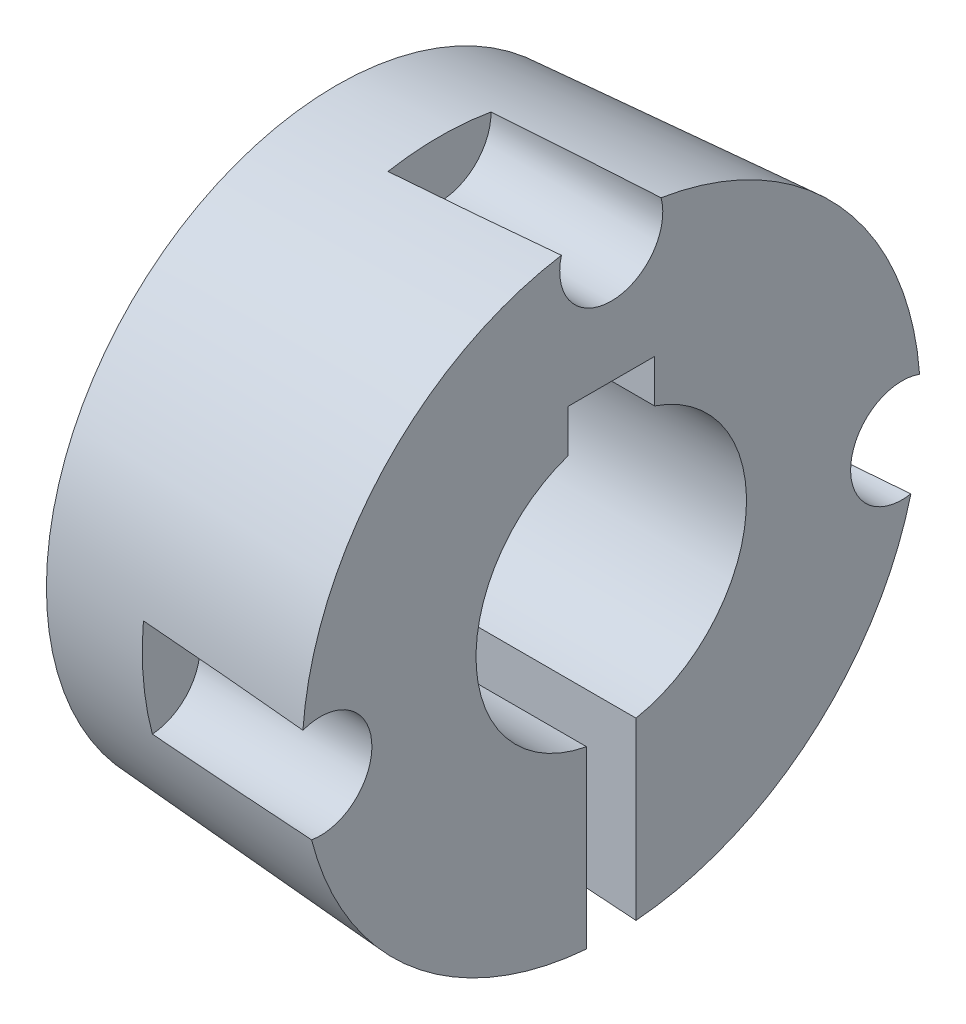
ISO-10303-21;
HEADER;
FILE_DESCRIPTION(('STEP AP214'),'2;1');
FILE_NAME('part.step','',(''),(''),'','','');
FILE_SCHEMA(('AUTOMOTIVE_DESIGN { 1 0 10303 214 1 1 1 1 }'));
ENDSEC;
DATA;
#1=APPLICATION_CONTEXT('core data for automotive mechanical design processes');
#2=APPLICATION_PROTOCOL_DEFINITION('international standard','automotive_design',2000,#1);
#3=PRODUCT_CONTEXT('',#1,'mechanical');
#4=PRODUCT('Part','Part','',(#3));
#5=PRODUCT_RELATED_PRODUCT_CATEGORY('part','',(#4));
#6=PRODUCT_DEFINITION_FORMATION('','',#4);
#7=PRODUCT_DEFINITION_CONTEXT('part definition',#1,'design');
#8=PRODUCT_DEFINITION('design','',#6,#7);
#9=PRODUCT_DEFINITION_SHAPE('','',#8);
#10=(LENGTH_UNIT() NAMED_UNIT(*) SI_UNIT(.MILLI.,.METRE.));
#11=(NAMED_UNIT(*) PLANE_ANGLE_UNIT() SI_UNIT($,.RADIAN.));
#12=(NAMED_UNIT(*) SI_UNIT($,.STERADIAN.) SOLID_ANGLE_UNIT());
#13=UNCERTAINTY_MEASURE_WITH_UNIT(LENGTH_MEASURE(1.E-05),#10,'distance_accuracy_value','');
#14=(GEOMETRIC_REPRESENTATION_CONTEXT(3) GLOBAL_UNCERTAINTY_ASSIGNED_CONTEXT((#13)) GLOBAL_UNIT_ASSIGNED_CONTEXT((#10,
#11,#12)) REPRESENTATION_CONTEXT('',''));
#15=CARTESIAN_POINT('',(0.,0.,0.));
#16=DIRECTION('',(0.,0.,1.));
#17=DIRECTION('',(1.,0.,0.));
#18=AXIS2_PLACEMENT_3D('',#15,#16,#17);
#19=CARTESIAN_POINT('',(25.4,14.2875,0.));
#20=DIRECTION('',(1.,0.,0.));
#21=DIRECTION('',(0.,-1.,0.));
#22=AXIS2_PLACEMENT_3D('',#19,#20,#21);
#23=PLANE('',#22);
#24=DIRECTION('',(0.,1.,0.));
#25=VECTOR('',#24,1.);
#26=CARTESIAN_POINT('',(25.4,-1.42875,2.286));
#27=LINE('',#26,#25);
#28=CARTESIAN_POINT('',(25.4,-28.4834132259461,2.286));
#29=VERTEX_POINT('',#28);
#30=CARTESIAN_POINT('',(25.4,-12.2891905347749,2.286));
#31=VERTEX_POINT('',#30);
#32=EDGE_CURVE('E264',#29,#31,#27,.T.);
#33=ORIENTED_EDGE('',*,*,#32,.T.);
#34=CARTESIAN_POINT('',(25.4,0.,0.));
#35=DIRECTION('',(-1.,0.,0.));
#36=DIRECTION('',(0.,0.,-1.));
#37=AXIS2_PLACEMENT_3D('',#34,#35,#36);
#38=CIRCLE('',#37,12.5);
#39=CARTESIAN_POINT('',(25.4,11.842719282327,4.));
#40=VERTEX_POINT('',#39);
#41=EDGE_CURVE('E129',#31,#40,#38,.T.);
#42=ORIENTED_EDGE('',*,*,#41,.T.);
#43=DIRECTION('',(0.,1.,0.));
#44=VECTOR('',#43,1.);
#45=CARTESIAN_POINT('',(25.4,11.09375,4.));
#46=LINE('',#45,#44);
#47=CARTESIAN_POINT('',(25.4,15.8,4.));
#48=VERTEX_POINT('',#47);
#49=EDGE_CURVE('E407',#40,#48,#46,.T.);
#50=ORIENTED_EDGE('',*,*,#49,.T.);
#51=DIRECTION('',(0.,0.,-1.));
#52=VECTOR('',#51,1.);
#53=CARTESIAN_POINT('',(25.4,15.8,0.));
#54=LINE('',#53,#52);
#55=CARTESIAN_POINT('',(25.4,15.8,-4.));
#56=VERTEX_POINT('',#55);
#57=EDGE_CURVE('E9',#48,#56,#54,.T.);
#58=ORIENTED_EDGE('',*,*,#57,.T.);
#59=DIRECTION('',(0.,-1.,0.));
#60=VECTOR('',#59,1.);
#61=CARTESIAN_POINT('',(25.4,11.09375,-4.));
#62=LINE('',#61,#60);
#63=CARTESIAN_POINT('',(25.4,11.842719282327,-4.));
#64=VERTEX_POINT('',#63);
#65=EDGE_CURVE('E307',#56,#64,#62,.T.);
#66=ORIENTED_EDGE('',*,*,#65,.T.);
#67=CARTESIAN_POINT('',(25.4,0.,0.));
#68=DIRECTION('',(-1.,0.,0.));
#69=DIRECTION('',(0.,0.,-1.));
#70=AXIS2_PLACEMENT_3D('',#67,#68,#69);
#71=CIRCLE('',#70,12.5);
#72=CARTESIAN_POINT('',(25.4,-12.2891905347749,-2.286));
#73=VERTEX_POINT('',#72);
#74=EDGE_CURVE('E394',#64,#73,#71,.T.);
#75=ORIENTED_EDGE('',*,*,#74,.T.);
#76=DIRECTION('',(0.,-1.,0.));
#77=VECTOR('',#76,1.);
#78=CARTESIAN_POINT('',(25.4,-1.42875,-2.286));
#79=LINE('',#78,#77);
#80=CARTESIAN_POINT('',(25.4,-28.4834132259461,-2.286));
#81=VERTEX_POINT('',#80);
#82=EDGE_CURVE('E274',#73,#81,#79,.T.);
#83=ORIENTED_EDGE('',*,*,#82,.T.);
#84=CARTESIAN_POINT('',(25.4,0.,0.));
#85=DIRECTION('',(-1.,0.,0.));
#86=DIRECTION('',(0.,1.,0.));
#87=AXIS2_PLACEMENT_3D('',#84,#85,#86);
#88=CIRCLE('',#87,28.575);
#89=CARTESIAN_POINT('',(25.4,-7.04557588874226,-27.6927876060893));
#90=VERTEX_POINT('',#89);
#91=EDGE_CURVE('E231',#90,#81,#88,.T.);
#92=ORIENTED_EDGE('',*,*,#91,.F.);
#93=CARTESIAN_POINT('',(25.4,-2.35211560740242,-26.884804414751));
#94=DIRECTION('',(-1.,0.,0.));
#95=DIRECTION('',(0.,-0.996194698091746,0.0871557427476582));
#96=AXIS2_PLACEMENT_3D('',#93,#94,#95);
#97=CIRCLE('',#96,4.7625);
#98=CARTESIAN_POINT('',(25.4,2.1297356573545,-28.4955233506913));
#99=VERTEX_POINT('',#98);
#100=EDGE_CURVE('E115',#90,#99,#97,.T.);
#101=ORIENTED_EDGE('',*,*,#100,.T.);
#102=CARTESIAN_POINT('',(25.4,0.,0.));
#103=DIRECTION('',(-1.,0.,0.));
#104=DIRECTION('',(0.,1.,0.));
#105=AXIS2_PLACEMENT_3D('',#102,#103,#104);
#106=CIRCLE('',#105,28.575);
#107=CARTESIAN_POINT('',(25.4,28.2014705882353,-4.60517987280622));
#108=VERTEX_POINT('',#107);
#109=EDGE_CURVE('E101',#108,#99,#106,.T.);
#110=ORIENTED_EDGE('',*,*,#109,.F.);
#111=CARTESIAN_POINT('',(25.4,26.9875,0.));
#112=DIRECTION('',(-1.,0.,0.));
#113=DIRECTION('',(0.,0.,-1.));
#114=AXIS2_PLACEMENT_3D('',#111,#112,#113);
#115=CIRCLE('',#114,4.7625);
#116=CARTESIAN_POINT('',(25.4,28.2014705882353,4.60517987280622));
#117=VERTEX_POINT('',#116);
#118=EDGE_CURVE('E312',#108,#117,#115,.T.);
#119=ORIENTED_EDGE('',*,*,#118,.T.);
#120=CARTESIAN_POINT('',(25.4,0.,0.));
#121=DIRECTION('',(-1.,0.,0.));
#122=DIRECTION('',(0.,1.,0.));
#123=AXIS2_PLACEMENT_3D('',#120,#121,#122);
#124=CIRCLE('',#123,28.575);
#125=CARTESIAN_POINT('',(25.4,2.1297356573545,28.4955233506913));
#126=VERTEX_POINT('',#125);
#127=EDGE_CURVE('E221',#126,#117,#124,.T.);
#128=ORIENTED_EDGE('',*,*,#127,.F.);
#129=CARTESIAN_POINT('',(25.4,-2.35211560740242,26.884804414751));
#130=DIRECTION('',(-1.,0.,0.));
#131=DIRECTION('',(0.,0.996194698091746,0.0871557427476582));
#132=AXIS2_PLACEMENT_3D('',#129,#130,#131);
#133=CIRCLE('',#132,4.7625);
#134=CARTESIAN_POINT('',(25.4,-7.04557588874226,27.6927876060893));
#135=VERTEX_POINT('',#134);
#136=EDGE_CURVE('E218',#126,#135,#133,.T.);
#137=ORIENTED_EDGE('',*,*,#136,.T.);
#138=CARTESIAN_POINT('',(25.4,0.,0.));
#139=DIRECTION('',(-1.,0.,0.));
#140=DIRECTION('',(0.,1.,0.));
#141=AXIS2_PLACEMENT_3D('',#138,#139,#140);
#142=CIRCLE('',#141,28.575);
#143=EDGE_CURVE('E118',#29,#135,#142,.T.);
#144=ORIENTED_EDGE('',*,*,#143,.F.);
#145=EDGE_LOOP('',(#33,#42,#50,#58,#66,#75,#83,#92,#101,#110,#119,#128,#137,#144));
#146=FACE_BOUND('',#145,.T.);
#147=ADVANCED_FACE('F15',(#146),#23,.T.);
#148=CARTESIAN_POINT('',(12.7,15.8,0.));
#149=DIRECTION('',(0.,-1.,0.));
#150=DIRECTION('',(0.,0.,-1.));
#151=AXIS2_PLACEMENT_3D('',#148,#149,#150);
#152=PLANE('',#151);
#153=DIRECTION('',(0.,0.,1.));
#154=VECTOR('',#153,1.);
#155=CARTESIAN_POINT('',(0.,15.8,0.));
#156=LINE('',#155,#154);
#157=CARTESIAN_POINT('',(0.,15.8,-4.));
#158=VERTEX_POINT('',#157);
#159=CARTESIAN_POINT('',(0.,15.8,4.));
#160=VERTEX_POINT('',#159);
#161=EDGE_CURVE('E286',#158,#160,#156,.T.);
#162=ORIENTED_EDGE('',*,*,#161,.F.);
#163=DIRECTION('',(1.,0.,0.));
#164=VECTOR('',#163,1.);
#165=CARTESIAN_POINT('',(12.7,15.8,-4.));
#166=LINE('',#165,#164);
#167=EDGE_CURVE('E27',#158,#56,#166,.T.);
#168=ORIENTED_EDGE('',*,*,#167,.T.);
#169=ORIENTED_EDGE('',*,*,#57,.F.);
#170=DIRECTION('',(-1.,0.,0.));
#171=VECTOR('',#170,1.);
#172=CARTESIAN_POINT('',(12.7,15.8,4.));
#173=LINE('',#172,#171);
#174=EDGE_CURVE('E315',#48,#160,#173,.T.);
#175=ORIENTED_EDGE('',*,*,#174,.T.);
#176=EDGE_LOOP('',(#162,#168,#169,#175));
#177=FACE_BOUND('',#176,.T.);
#178=ADVANCED_FACE('F366',(#177),#152,.T.);
#179=CARTESIAN_POINT('',(12.7,7.9,-4.));
#180=DIRECTION('',(0.,0.,1.));
#181=DIRECTION('',(1.,0.,0.));
#182=AXIS2_PLACEMENT_3D('',#179,#180,#181);
#183=PLANE('',#182);
#184=DIRECTION('',(0.,1.,0.));
#185=VECTOR('',#184,1.);
#186=CARTESIAN_POINT('',(0.,10.6504363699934,-4.));
#187=LINE('',#186,#185);
#188=CARTESIAN_POINT('',(0.,11.842719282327,-4.));
#189=VERTEX_POINT('',#188);
#190=EDGE_CURVE('E290',#189,#158,#187,.T.);
#191=ORIENTED_EDGE('',*,*,#190,.F.);
#192=DIRECTION('',(-1.,0.,0.));
#193=VECTOR('',#192,1.);
#194=CARTESIAN_POINT('',(12.7,11.842719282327,-4.));
#195=LINE('',#194,#193);
#196=EDGE_CURVE('E302',#64,#189,#195,.T.);
#197=ORIENTED_EDGE('',*,*,#196,.F.);
#198=ORIENTED_EDGE('',*,*,#65,.F.);
#199=ORIENTED_EDGE('',*,*,#167,.F.);
#200=EDGE_LOOP('',(#191,#197,#198,#199));
#201=FACE_BOUND('',#200,.T.);
#202=ADVANCED_FACE('F358',(#201),#183,.T.);
#203=CARTESIAN_POINT('',(12.7,7.9,4.));
#204=DIRECTION('',(0.,0.,1.));
#205=DIRECTION('',(1.,0.,0.));
#206=AXIS2_PLACEMENT_3D('',#203,#204,#205);
#207=PLANE('',#206);
#208=DIRECTION('',(0.,-1.,0.));
#209=VECTOR('',#208,1.);
#210=CARTESIAN_POINT('',(0.,10.6504363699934,4.));
#211=LINE('',#210,#209);
#212=CARTESIAN_POINT('',(0.,11.842719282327,4.));
#213=VERTEX_POINT('',#212);
#214=EDGE_CURVE('E289',#160,#213,#211,.T.);
#215=ORIENTED_EDGE('',*,*,#214,.F.);
#216=ORIENTED_EDGE('',*,*,#174,.F.);
#217=ORIENTED_EDGE('',*,*,#49,.F.);
#218=DIRECTION('',(1.,0.,0.));
#219=VECTOR('',#218,1.);
#220=CARTESIAN_POINT('',(12.7,11.842719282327,4.));
#221=LINE('',#220,#219);
#222=EDGE_CURVE('E132',#213,#40,#221,.T.);
#223=ORIENTED_EDGE('',*,*,#222,.F.);
#224=EDGE_LOOP('',(#215,#216,#217,#223));
#225=FACE_BOUND('',#224,.T.);
#226=ADVANCED_FACE('F355',(#225),#207,.F.);
#227=CARTESIAN_POINT('',(17.9625,26.9875,0.));
#228=DIRECTION('',(-1.,0.,0.));
#229=DIRECTION('',(0.,0.,-1.));
#230=AXIS2_PLACEMENT_3D('',#227,#228,#229);
#231=CYLINDRICAL_SURFACE('',#230,4.7625);
#232=CARTESIAN_POINT('',(25.3999989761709,28.201475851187,4.60514719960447));
#233=CARTESIAN_POINT('',(24.7489113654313,28.1533533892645,4.61779770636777));
#234=CARTESIAN_POINT('',(24.0977998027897,28.1053413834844,4.62963009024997));
#235=CARTESIAN_POINT('',(22.7926204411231,28.009326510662,4.65174823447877));
#236=CARTESIAN_POINT('',(22.138552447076,27.9613246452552,4.66202683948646));
#237=CARTESIAN_POINT('',(20.8274602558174,27.8653353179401,4.68105689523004));
#238=CARTESIAN_POINT('',(20.1704358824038,27.8173488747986,4.68980133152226));
#239=CARTESIAN_POINT('',(18.8534308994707,27.7213946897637,4.70578237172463));
#240=CARTESIAN_POINT('',(18.193450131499,27.6734279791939,4.71301210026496));
#241=CARTESIAN_POINT('',(16.8705323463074,27.5775168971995,4.72598319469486));
#242=CARTESIAN_POINT('',(16.2075951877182,27.5295735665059,4.73171782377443));
#243=CARTESIAN_POINT('',(14.8787646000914,27.433712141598,4.74171823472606));
#244=CARTESIAN_POINT('',(14.2128710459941,27.3857950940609,4.74597741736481));
#245=CARTESIAN_POINT('',(12.8781276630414,27.2899884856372,4.75304659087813));
#246=CARTESIAN_POINT('',(12.2092777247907,27.2420999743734,4.75585011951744));
#247=CARTESIAN_POINT('',(10.86862151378,27.1463518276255,4.76002748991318));
#248=CARTESIAN_POINT('',(10.1968151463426,27.0984932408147,4.76139500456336));
#249=CARTESIAN_POINT('',(9.52499968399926,27.0507541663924,4.7620564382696));
#250=B_SPLINE_CURVE_WITH_KNOTS('',3,(#232,#233,#234,#235,#236,#237,#238,#239,#240,#241,#242,
#243,#244,#245,#246,#247,#248,#249),.UNSPECIFIED.,.F.,.F.,(4,2,2,2,2,2,2,2,4),(0.,
1.95895770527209,3.9266784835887,5.90317393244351,7.88845525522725,9.88253326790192,
11.8854184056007,13.8971207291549,15.9176499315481),.UNSPECIFIED.);
#251=CARTESIAN_POINT('',(9.525,27.0507500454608,4.76207997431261));
#252=VERTEX_POINT('',#251);
#253=EDGE_CURVE('E245',#117,#252,#250,.T.);
#254=ORIENTED_EDGE('',*,*,#253,.F.);
#255=ORIENTED_EDGE('',*,*,#118,.F.);
#256=CARTESIAN_POINT('',(9.52499968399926,27.0507541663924,-4.76205643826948));
#257=CARTESIAN_POINT('',(10.1968151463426,27.0984932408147,-4.76139500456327));
#258=CARTESIAN_POINT('',(10.86862151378,27.1463518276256,-4.7600274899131));
#259=CARTESIAN_POINT('',(12.2092777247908,27.2420999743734,-4.75585011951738));
#260=CARTESIAN_POINT('',(12.8781276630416,27.2899884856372,-4.75304659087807));
#261=CARTESIAN_POINT('',(14.2128710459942,27.3857950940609,-4.74597741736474));
#262=CARTESIAN_POINT('',(14.8787646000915,27.433712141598,-4.74171823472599));
#263=CARTESIAN_POINT('',(16.2075951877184,27.5295735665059,-4.73171782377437));
#264=CARTESIAN_POINT('',(16.8705323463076,27.5775168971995,-4.72598319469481));
#265=CARTESIAN_POINT('',(18.1934501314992,27.6734279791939,-4.71301210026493));
#266=CARTESIAN_POINT('',(18.8534308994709,27.7213946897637,-4.70578237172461));
#267=CARTESIAN_POINT('',(20.1704358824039,27.8173488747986,-4.68980133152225));
#268=CARTESIAN_POINT('',(20.8274602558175,27.8653353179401,-4.68105689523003));
#269=CARTESIAN_POINT('',(22.1385524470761,27.9613246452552,-4.66202683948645));
#270=CARTESIAN_POINT('',(22.7926204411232,28.009326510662,-4.65174823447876));
#271=CARTESIAN_POINT('',(24.0977998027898,28.1053413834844,-4.62963009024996));
#272=CARTESIAN_POINT('',(24.7489113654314,28.1533533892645,-4.61779770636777));
#273=CARTESIAN_POINT('',(25.3999989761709,28.201475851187,-4.60514719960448));
#274=B_SPLINE_CURVE_WITH_KNOTS('',3,(#256,#257,#258,#259,#260,#261,#262,#263,#264,#265,#266,
#267,#268,#269,#270,#271,#272,#273),.UNSPECIFIED.,.F.,.F.,(4,2,2,2,2,2,2,2,4),(0.,
2.02052920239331,4.03223152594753,6.03511666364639,8.02919467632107,10.0144759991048,
11.9909714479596,13.9586922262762,15.9176499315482),.UNSPECIFIED.);
#275=CARTESIAN_POINT('',(9.525,27.0507500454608,-4.76207997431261));
#276=VERTEX_POINT('',#275);
#277=EDGE_CURVE('E239',#276,#108,#274,.T.);
#278=ORIENTED_EDGE('',*,*,#277,.F.);
#279=CARTESIAN_POINT('',(9.525,26.9875,0.));
#280=DIRECTION('',(-1.,0.,0.));
#281=DIRECTION('',(0.,0.,-1.));
#282=AXIS2_PLACEMENT_3D('',#279,#280,#281);
#283=CIRCLE('',#282,4.7625);
#284=EDGE_CURVE('E254',#276,#252,#283,.T.);
#285=ORIENTED_EDGE('',*,*,#284,.T.);
#286=EDGE_LOOP('',(#254,#255,#278,#285));
#287=FACE_BOUND('',#286,.T.);
#288=ADVANCED_FACE('F151',(#287),#231,.F.);
#289=CARTESIAN_POINT('',(9.525,26.9875,0.));
#290=DIRECTION('',(-1.,0.,0.));
#291=DIRECTION('',(0.,0.,1.));
#292=AXIS2_PLACEMENT_3D('',#289,#290,#291);
#293=PLANE('',#292);
#294=CARTESIAN_POINT('',(9.525,0.,0.));
#295=DIRECTION('',(-1.,0.,0.));
#296=DIRECTION('',(0.,1.,0.));
#297=AXIS2_PLACEMENT_3D('',#294,#295,#296);
#298=CIRCLE('',#297,27.4667159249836);
#299=EDGE_CURVE('E242',#252,#276,#298,.T.);
#300=ORIENTED_EDGE('',*,*,#299,.F.);
#301=ORIENTED_EDGE('',*,*,#284,.F.);
#302=EDGE_LOOP('',(#300,#301));
#303=FACE_BOUND('',#302,.T.);
#304=ADVANCED_FACE('F202',(#303),#293,.F.);
#305=CARTESIAN_POINT('',(17.9625,-2.35211560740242,26.884804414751));
#306=DIRECTION('',(-1.,0.,0.));
#307=DIRECTION('',(0.,0.996194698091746,0.0871557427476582));
#308=AXIS2_PLACEMENT_3D('',#305,#306,#307);
#309=CYLINDRICAL_SURFACE('',#308,4.7625);
#310=CARTESIAN_POINT('',(25.3999989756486,-7.04554378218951,27.6927957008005));
#311=CARTESIAN_POINT('',(24.7489109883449,-7.05395200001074,27.6437537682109));
#312=CARTESIAN_POINT('',(24.0977990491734,-7.06155483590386,27.5948931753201));
#313=CARTESIAN_POINT('',(22.7926190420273,-7.07522056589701,27.49731589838));
#314=CARTESIAN_POINT('',(22.1385507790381,-7.08127641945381,27.4486008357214));
#315=CARTESIAN_POINT('',(20.8274581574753,-7.09186803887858,27.3513181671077));
#316=CARTESIAN_POINT('',(20.1704336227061,-7.09639690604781,27.30275218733));
#317=CARTESIAN_POINT('',(18.853428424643,-7.10395417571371,27.2057702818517));
#318=CARTESIAN_POINT('',(18.1934476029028,-7.10697581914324,27.157355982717));
#319=CARTESIAN_POINT('',(16.8705298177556,-7.11153835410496,27.0606793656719));
#320=CARTESIAN_POINT('',(16.2075927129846,-7.11307262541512,27.0124186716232));
#321=CARTESIAN_POINT('',(14.8787623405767,-7.11468010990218,26.9160504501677));
#322=CARTESIAN_POINT('',(14.2128689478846,-7.11474684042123,26.8679445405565));
#323=CARTESIAN_POINT('',(12.8781259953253,-7.11343902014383,26.771886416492));
#324=CARTESIAN_POINT('',(12.2092763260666,-7.11205812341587,26.7239358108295));
#325=CARTESIAN_POINT('',(10.8686207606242,-7.10787460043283,26.6281879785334));
#326=CARTESIAN_POINT('',(10.1968147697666,-7.10506576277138,26.5803923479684));
#327=CARTESIAN_POINT('',(9.52499968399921,-7.10156394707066,26.5327773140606));
#328=B_SPLINE_CURVE_WITH_KNOTS('',3,(#310,#311,#312,#313,#314,#315,#316,#317,#318,#319,#320,
#321,#322,#323,#324,#325,#326,#327),.UNSPECIFIED.,.F.,.F.,(4,2,2,2,2,2,2,2,4),(0.,
1.95895883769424,3.92668042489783,5.90317635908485,7.88845784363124,9.88253569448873,
11.8854203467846,13.897121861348,15.9176499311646),.UNSPECIFIED.);
#329=CARTESIAN_POINT('',(9.525,-7.10158703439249,26.5327711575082));
#330=VERTEX_POINT('',#329);
#331=EDGE_CURVE('E189',#135,#330,#328,.T.);
#332=ORIENTED_EDGE('',*,*,#331,.F.);
#333=ORIENTED_EDGE('',*,*,#136,.F.);
#334=CARTESIAN_POINT('',(9.52499968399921,2.38630680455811,27.3628584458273));
#335=CARTESIAN_POINT('',(10.1968147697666,2.38148715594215,27.4103581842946));
#336=CARTESIAN_POINT('',(10.8686207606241,2.37595369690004,27.4579154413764));
#337=CARTESIAN_POINT('',(12.2092763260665,2.36344722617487,27.5529351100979));
#338=CARTESIAN_POINT('',(12.8781259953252,2.35648060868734,27.6003970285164));
#339=CARTESIAN_POINT('',(14.2128689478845,2.34108824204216,27.6952229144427));
#340=CARTESIAN_POINT('',(14.8787623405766,2.33266902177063,27.7425863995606));
#341=CARTESIAN_POINT('',(16.2075927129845,2.31435179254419,27.8372114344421));
#342=CARTESIAN_POINT('',(16.8705298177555,2.30446044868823,27.8844725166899));
#343=CARTESIAN_POINT('',(18.1934476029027,2.28317951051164,27.9788881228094));
#344=CARTESIAN_POINT('',(18.8534284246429,2.27179671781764,28.0260421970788));
#345=CARTESIAN_POINT('',(20.170433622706,2.24751352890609,28.12023842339));
#346=CARTESIAN_POINT('',(20.8274581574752,2.23462007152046,28.167280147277));
#347=CARTESIAN_POINT('',(22.1385507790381,2.20729640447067,28.2612456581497));
#348=CARTESIAN_POINT('',(22.7926190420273,2.19287327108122,28.3081690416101));
#349=CARTESIAN_POINT('',(24.0977990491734,2.16247103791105,28.4018908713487));
#350=CARTESIAN_POINT('',(24.7489109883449,2.14649915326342,28.4486889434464));
#351=CARTESIAN_POINT('',(25.3999989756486,2.12970263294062,28.4955257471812));
#352=B_SPLINE_CURVE_WITH_KNOTS('',3,(#334,#335,#336,#337,#338,#339,#340,#341,#342,#343,#344,
#345,#346,#347,#348,#349,#350,#351),.UNSPECIFIED.,.F.,.F.,(4,2,2,2,2,2,2,2,4),(0.,
2.02052806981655,4.03222958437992,6.03511423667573,8.02919208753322,10.0144735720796,
11.9909695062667,13.9586910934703,15.9176499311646),.UNSPECIFIED.);
#353=CARTESIAN_POINT('',(9.525,2.38633061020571,27.3628563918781));
#354=VERTEX_POINT('',#353);
#355=EDGE_CURVE('E214',#354,#126,#352,.T.);
#356=ORIENTED_EDGE('',*,*,#355,.F.);
#357=CARTESIAN_POINT('',(9.525,-2.35211560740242,26.884804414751));
#358=DIRECTION('',(-1.,0.,0.));
#359=DIRECTION('',(0.,0.996194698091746,0.0871557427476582));
#360=AXIS2_PLACEMENT_3D('',#357,#358,#359);
#361=CIRCLE('',#360,4.7625);
#362=EDGE_CURVE('E216',#354,#330,#361,.T.);
#363=ORIENTED_EDGE('',*,*,#362,.T.);
#364=EDGE_LOOP('',(#332,#333,#356,#363));
#365=FACE_BOUND('',#364,.T.);
#366=ADVANCED_FACE('F193',(#365),#309,.F.);
#367=CARTESIAN_POINT('',(9.525,-2.35211560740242,26.884804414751));
#368=DIRECTION('',(-1.,0.,0.));
#369=DIRECTION('',(0.,-0.996194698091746,-0.0871557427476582));
#370=AXIS2_PLACEMENT_3D('',#367,#368,#369);
#371=PLANE('',#370);
#372=CARTESIAN_POINT('',(9.525,0.,0.));
#373=DIRECTION('',(-1.,0.,0.));
#374=DIRECTION('',(0.,1.,0.));
#375=AXIS2_PLACEMENT_3D('',#372,#373,#374);
#376=CIRCLE('',#375,27.4667159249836);
#377=EDGE_CURVE('E222',#330,#354,#376,.T.);
#378=ORIENTED_EDGE('',*,*,#377,.F.);
#379=ORIENTED_EDGE('',*,*,#362,.F.);
#380=EDGE_LOOP('',(#378,#379));
#381=FACE_BOUND('',#380,.T.);
#382=ADVANCED_FACE('F149',(#381),#371,.F.);
#383=CARTESIAN_POINT('',(12.7,0.,0.));
#384=DIRECTION('',(1.,0.,0.));
#385=DIRECTION('',(0.,1.,0.));
#386=AXIS2_PLACEMENT_3D('',#383,#384,#385);
#387=CONICAL_SURFACE('',#386,27.6883727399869,0.0697000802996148);
#388=CARTESIAN_POINT('',(0.,-26.7040776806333,2.286));
#389=CARTESIAN_POINT('',(12.2906679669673,-27.5652664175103,2.286));
#390=CARTESIAN_POINT('',(25.4002937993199,-28.48343380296,2.286));
#391=(BOUNDED_CURVE() B_SPLINE_CURVE(2,(#388,#389,#390),.UNSPECIFIED.,.F.,
.F.) B_SPLINE_CURVE_WITH_KNOTS((3,3),(0.,25.4625417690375),
.UNSPECIFIED.) CURVE() GEOMETRIC_REPRESENTATION_ITEM() RATIONAL_B_SPLINE_CURVE((1.,
1.00051663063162,1.)) REPRESENTATION_ITEM(''));
#392=CARTESIAN_POINT('',(0.,-26.7040776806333,2.286));
#393=VERTEX_POINT('',#392);
#394=EDGE_CURVE('E261',#393,#29,#391,.T.);
#395=ORIENTED_EDGE('',*,*,#394,.T.);
#396=ORIENTED_EDGE('',*,*,#143,.T.);
#397=ORIENTED_EDGE('',*,*,#331,.T.);
#398=ORIENTED_EDGE('',*,*,#377,.T.);
#399=ORIENTED_EDGE('',*,*,#355,.T.);
#400=ORIENTED_EDGE('',*,*,#127,.T.);
#401=ORIENTED_EDGE('',*,*,#253,.T.);
#402=ORIENTED_EDGE('',*,*,#299,.T.);
#403=ORIENTED_EDGE('',*,*,#277,.T.);
#404=ORIENTED_EDGE('',*,*,#109,.T.);
#405=CARTESIAN_POINT('',(25.3999989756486,2.12970263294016,-28.4955257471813));
#406=CARTESIAN_POINT('',(24.748910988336,2.14649915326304,-28.4486889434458));
#407=CARTESIAN_POINT('',(24.0977990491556,2.16247103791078,-28.4018908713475));
#408=CARTESIAN_POINT('',(22.7926190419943,2.19287327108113,-28.3081690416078));
#409=CARTESIAN_POINT('',(22.1385507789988,2.20729640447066,-28.261245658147));
#410=CARTESIAN_POINT('',(20.8274581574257,2.23462007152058,-28.1672801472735));
#411=CARTESIAN_POINT('',(20.1704336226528,2.24751352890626,-28.1202384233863));
#412=CARTESIAN_POINT('',(18.8534284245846,2.2717967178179,-28.0260421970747));
#413=CARTESIAN_POINT('',(18.193447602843,2.28317951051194,-27.9788881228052));
#414=CARTESIAN_POINT('',(16.8705298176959,2.30446044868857,-27.8844725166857));
#415=CARTESIAN_POINT('',(16.2075927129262,2.31435179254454,-27.837211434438));
#416=CARTESIAN_POINT('',(14.8787623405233,2.33266902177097,-27.7425863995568));
#417=CARTESIAN_POINT('',(14.2128689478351,2.3410882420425,-27.6952229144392));
#418=CARTESIAN_POINT('',(12.8781259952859,2.35648060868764,-27.6003970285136));
#419=CARTESIAN_POINT('',(12.2092763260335,2.36344722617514,-27.5529351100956));
#420=CARTESIAN_POINT('',(10.8686207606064,2.37595369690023,-27.4579154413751));
#421=CARTESIAN_POINT('',(10.1968147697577,2.3814871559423,-27.4103581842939));
#422=CARTESIAN_POINT('',(9.52499968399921,2.38630680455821,-27.3628584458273));
#423=B_SPLINE_CURVE_WITH_KNOTS('',3,(#405,#406,#407,#408,#409,#410,#411,#412,#413,#414,#415,
#416,#417,#418,#419,#420,#421,#422),.UNSPECIFIED.,.F.,.F.,(4,2,2,2,2,2,2,2,4),(0.,
1.95895883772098,3.92668042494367,5.90317635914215,7.88845784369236,9.88253569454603,
11.8854203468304,13.8971218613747,15.9176499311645),.UNSPECIFIED.);
#424=CARTESIAN_POINT('',(9.525,2.38633061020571,-27.3628563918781));
#425=VERTEX_POINT('',#424);
#426=EDGE_CURVE('E124',#99,#425,#423,.T.);
#427=ORIENTED_EDGE('',*,*,#426,.T.);
#428=CARTESIAN_POINT('',(9.525,0.,0.));
#429=DIRECTION('',(-1.,0.,0.));
#430=DIRECTION('',(0.,1.,0.));
#431=AXIS2_PLACEMENT_3D('',#428,#429,#430);
#432=CIRCLE('',#431,27.4667159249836);
#433=CARTESIAN_POINT('',(9.525,-7.10158703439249,-26.5327711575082));
#434=VERTEX_POINT('',#433);
#435=EDGE_CURVE('E123',#425,#434,#432,.T.);
#436=ORIENTED_EDGE('',*,*,#435,.T.);
#437=CARTESIAN_POINT('',(9.52499968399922,-7.10156394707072,-26.5327773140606));
#438=CARTESIAN_POINT('',(10.1968147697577,-7.10506576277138,-26.5803923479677));
#439=CARTESIAN_POINT('',(10.8686207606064,-7.10787460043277,-26.6281879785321));
#440=CARTESIAN_POINT('',(12.2092763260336,-7.11205812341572,-26.7239358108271));
#441=CARTESIAN_POINT('',(12.8781259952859,-7.11343902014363,-26.7718864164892));
#442=CARTESIAN_POINT('',(14.2128689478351,-7.11474684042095,-26.867944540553));
#443=CARTESIAN_POINT('',(14.8787623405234,-7.11468010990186,-26.916050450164));
#444=CARTESIAN_POINT('',(16.2075927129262,-7.11307262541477,-27.0124186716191));
#445=CARTESIAN_POINT('',(16.8705298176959,-7.1115383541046,-27.0606793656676));
#446=CARTESIAN_POINT('',(18.1934476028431,-7.10697581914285,-27.1573559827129));
#447=CARTESIAN_POINT('',(18.8534284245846,-7.10395417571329,-27.2057702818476));
#448=CARTESIAN_POINT('',(20.1704336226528,-7.09639690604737,-27.3027521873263));
#449=CARTESIAN_POINT('',(20.8274581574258,-7.09186803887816,-27.3513181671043));
#450=CARTESIAN_POINT('',(22.1385507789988,-7.08127641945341,-27.4486008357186));
#451=CARTESIAN_POINT('',(22.7926190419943,-7.07522056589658,-27.4973158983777));
#452=CARTESIAN_POINT('',(24.0977990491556,-7.06155483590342,-27.5948931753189));
#453=CARTESIAN_POINT('',(24.748910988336,-7.0539520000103,-27.6437537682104));
#454=CARTESIAN_POINT('',(25.3999989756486,-7.04554378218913,-27.6927957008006));
#455=B_SPLINE_CURVE_WITH_KNOTS('',3,(#437,#438,#439,#440,#441,#442,#443,#444,#445,#446,#447,
#448,#449,#450,#451,#452,#453,#454),.UNSPECIFIED.,.F.,.F.,(4,2,2,2,2,2,2,2,4),(0.,
2.02052806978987,4.03222958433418,6.03511423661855,8.02919208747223,10.0144735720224,
11.9909695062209,13.9586910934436,15.9176499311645),.UNSPECIFIED.);
#456=EDGE_CURVE('E108',#434,#90,#455,.T.);
#457=ORIENTED_EDGE('',*,*,#456,.T.);
#458=ORIENTED_EDGE('',*,*,#91,.T.);
#459=CARTESIAN_POINT('',(25.4002937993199,-28.48343380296,-2.286));
#460=CARTESIAN_POINT('',(12.2906679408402,-27.56526641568,-2.286));
#461=CARTESIAN_POINT('',(0.,-26.7040776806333,-2.286));
#462=(BOUNDED_CURVE() B_SPLINE_CURVE(2,(#459,#460,#461),.UNSPECIFIED.,.F.,
.F.) B_SPLINE_CURVE_WITH_KNOTS((3,3),(0.,25.4625417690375),
.UNSPECIFIED.) CURVE() GEOMETRIC_REPRESENTATION_ITEM() RATIONAL_B_SPLINE_CURVE((1.,
1.00051663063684,1.)) REPRESENTATION_ITEM(''));
#463=CARTESIAN_POINT('',(0.,-26.7040776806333,-2.286));
#464=VERTEX_POINT('',#463);
#465=EDGE_CURVE('E271',#81,#464,#462,.T.);
#466=ORIENTED_EDGE('',*,*,#465,.T.);
#467=CARTESIAN_POINT('',(0.,0.,0.));
#468=DIRECTION('',(-1.,0.,0.));
#469=DIRECTION('',(0.,1.,0.));
#470=AXIS2_PLACEMENT_3D('',#467,#468,#469);
#471=CIRCLE('',#470,26.8017454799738);
#472=EDGE_CURVE('E284',#393,#464,#471,.T.);
#473=ORIENTED_EDGE('',*,*,#472,.F.);
#474=EDGE_LOOP('',(#395,#396,#397,#398,#399,#400,#401,#402,#403,#404,#427,#436,#457,#458,#466,#473));
#475=FACE_BOUND('',#474,.T.);
#476=ADVANCED_FACE('F127',(#475),#387,.T.);
#477=CARTESIAN_POINT('',(17.9625,-2.35211560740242,-26.884804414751));
#478=DIRECTION('',(-1.,0.,0.));
#479=DIRECTION('',(0.,-0.996194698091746,0.0871557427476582));
#480=AXIS2_PLACEMENT_3D('',#477,#478,#479);
#481=CYLINDRICAL_SURFACE('',#480,4.7625);
#482=ORIENTED_EDGE('',*,*,#426,.F.);
#483=ORIENTED_EDGE('',*,*,#100,.F.);
#484=ORIENTED_EDGE('',*,*,#456,.F.);
#485=CARTESIAN_POINT('',(9.525,-2.35211560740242,-26.884804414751));
#486=DIRECTION('',(-1.,0.,0.));
#487=DIRECTION('',(0.,-0.996194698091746,0.0871557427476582));
#488=AXIS2_PLACEMENT_3D('',#485,#486,#487);
#489=CIRCLE('',#488,4.7625);
#490=EDGE_CURVE('E113',#434,#425,#489,.T.);
#491=ORIENTED_EDGE('',*,*,#490,.T.);
#492=EDGE_LOOP('',(#482,#483,#484,#491));
#493=FACE_BOUND('',#492,.T.);
#494=ADVANCED_FACE('F112',(#493),#481,.F.);
#495=CARTESIAN_POINT('',(9.525,-2.35211560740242,-26.884804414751));
#496=DIRECTION('',(-1.,0.,0.));
#497=DIRECTION('',(0.,0.996194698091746,-0.0871557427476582));
#498=AXIS2_PLACEMENT_3D('',#495,#496,#497);
#499=PLANE('',#498);
#500=ORIENTED_EDGE('',*,*,#435,.F.);
#501=ORIENTED_EDGE('',*,*,#490,.F.);
#502=EDGE_LOOP('',(#500,#501));
#503=FACE_BOUND('',#502,.T.);
#504=ADVANCED_FACE('F122',(#503),#499,.F.);
#505=CARTESIAN_POINT('',(12.7,0.,0.));
#506=DIRECTION('',(-1.,0.,0.));
#507=DIRECTION('',(0.,0.,-1.));
#508=AXIS2_PLACEMENT_3D('',#505,#506,#507);
#509=CYLINDRICAL_SURFACE('',#508,12.5);
#510=DIRECTION('',(-1.,0.,0.));
#511=VECTOR('',#510,1.);
#512=CARTESIAN_POINT('',(12.7,-12.2891905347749,2.286));
#513=LINE('',#512,#511);
#514=CARTESIAN_POINT('',(0.,-12.2891905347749,2.286));
#515=VERTEX_POINT('',#514);
#516=EDGE_CURVE('E270',#31,#515,#513,.T.);
#517=ORIENTED_EDGE('',*,*,#516,.T.);
#518=CARTESIAN_POINT('',(0.,0.,0.));
#519=DIRECTION('',(1.,0.,0.));
#520=DIRECTION('',(0.,0.,-1.));
#521=AXIS2_PLACEMENT_3D('',#518,#519,#520);
#522=CIRCLE('',#521,12.5);
#523=EDGE_CURVE('E280',#213,#515,#522,.T.);
#524=ORIENTED_EDGE('',*,*,#523,.F.);
#525=ORIENTED_EDGE('',*,*,#222,.T.);
#526=ORIENTED_EDGE('',*,*,#41,.F.);
#527=EDGE_LOOP('',(#517,#524,#525,#526));
#528=FACE_BOUND('',#527,.T.);
#529=ADVANCED_FACE('F17',(#528),#509,.F.);
#530=CARTESIAN_POINT('',(12.7,0.,0.));
#531=DIRECTION('',(-1.,0.,0.));
#532=DIRECTION('',(0.,0.,-1.));
#533=AXIS2_PLACEMENT_3D('',#530,#531,#532);
#534=CYLINDRICAL_SURFACE('',#533,12.5);
#535=DIRECTION('',(1.,0.,0.));
#536=VECTOR('',#535,1.);
#537=CARTESIAN_POINT('',(12.7,-12.2891905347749,-2.286));
#538=LINE('',#537,#536);
#539=CARTESIAN_POINT('',(0.,-12.2891905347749,-2.286));
#540=VERTEX_POINT('',#539);
#541=EDGE_CURVE('E285',#540,#73,#538,.T.);
#542=ORIENTED_EDGE('',*,*,#541,.T.);
#543=ORIENTED_EDGE('',*,*,#74,.F.);
#544=ORIENTED_EDGE('',*,*,#196,.T.);
#545=CARTESIAN_POINT('',(0.,0.,0.));
#546=DIRECTION('',(1.,0.,0.));
#547=DIRECTION('',(0.,0.,-1.));
#548=AXIS2_PLACEMENT_3D('',#545,#546,#547);
#549=CIRCLE('',#548,12.5);
#550=EDGE_CURVE('E294',#540,#189,#549,.T.);
#551=ORIENTED_EDGE('',*,*,#550,.F.);
#552=EDGE_LOOP('',(#542,#543,#544,#551));
#553=FACE_BOUND('',#552,.T.);
#554=ADVANCED_FACE('F379',(#553),#534,.F.);
#555=CARTESIAN_POINT('',(0.,13.4008727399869,0.));
#556=DIRECTION('',(-1.,0.,0.));
#557=DIRECTION('',(0.,1.,0.));
#558=AXIS2_PLACEMENT_3D('',#555,#556,#557);
#559=PLANE('',#558);
#560=DIRECTION('',(0.,-1.,0.));
#561=VECTOR('',#560,1.);
#562=CARTESIAN_POINT('',(0.,-1.87206363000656,2.286));
#563=LINE('',#562,#561);
#564=EDGE_CURVE('E276',#515,#393,#563,.T.);
#565=ORIENTED_EDGE('',*,*,#564,.T.);
#566=ORIENTED_EDGE('',*,*,#472,.T.);
#567=DIRECTION('',(0.,1.,0.));
#568=VECTOR('',#567,1.);
#569=CARTESIAN_POINT('',(0.,-1.87206363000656,-2.286));
#570=LINE('',#569,#568);
#571=EDGE_CURVE('E281',#464,#540,#570,.T.);
#572=ORIENTED_EDGE('',*,*,#571,.T.);
#573=ORIENTED_EDGE('',*,*,#550,.T.);
#574=ORIENTED_EDGE('',*,*,#190,.T.);
#575=ORIENTED_EDGE('',*,*,#161,.T.);
#576=ORIENTED_EDGE('',*,*,#214,.T.);
#577=ORIENTED_EDGE('',*,*,#523,.T.);
#578=EDGE_LOOP('',(#565,#566,#572,#573,#574,#575,#576,#577));
#579=FACE_BOUND('',#578,.T.);
#580=ADVANCED_FACE('F381',(#579),#559,.T.);
#581=CARTESIAN_POINT('',(12.7,-17.145,-2.286));
#582=DIRECTION('',(0.,0.,1.));
#583=DIRECTION('',(1.,0.,0.));
#584=AXIS2_PLACEMENT_3D('',#581,#582,#583);
#585=PLANE('',#584);
#586=ORIENTED_EDGE('',*,*,#465,.F.);
#587=ORIENTED_EDGE('',*,*,#82,.F.);
#588=ORIENTED_EDGE('',*,*,#541,.F.);
#589=ORIENTED_EDGE('',*,*,#571,.F.);
#590=EDGE_LOOP('',(#586,#587,#588,#589));
#591=FACE_BOUND('',#590,.T.);
#592=ADVANCED_FACE('F353',(#591),#585,.T.);
#593=CARTESIAN_POINT('',(12.7,-17.145,2.286));
#594=DIRECTION('',(0.,0.,1.));
#595=DIRECTION('',(1.,0.,0.));
#596=AXIS2_PLACEMENT_3D('',#593,#594,#595);
#597=PLANE('',#596);
#598=ORIENTED_EDGE('',*,*,#394,.F.);
#599=ORIENTED_EDGE('',*,*,#564,.F.);
#600=ORIENTED_EDGE('',*,*,#516,.F.);
#601=ORIENTED_EDGE('',*,*,#32,.F.);
#602=EDGE_LOOP('',(#598,#599,#600,#601));
#603=FACE_BOUND('',#602,.T.);
#604=ADVANCED_FACE('F267',(#603),#597,.F.);
#605=CLOSED_SHELL('',(#147,#178,#202,#226,#288,#304,#366,#382,#476,#494,#504,#529,#554,#580,
#592,#604));
#606=MANIFOLD_SOLID_BREP('B1',#605);
#607=ADVANCED_BREP_SHAPE_REPRESENTATION('',(#18,#606),#14);
#608=SHAPE_DEFINITION_REPRESENTATION(#9,#607);
ENDSEC;
END-ISO-10303-21;
